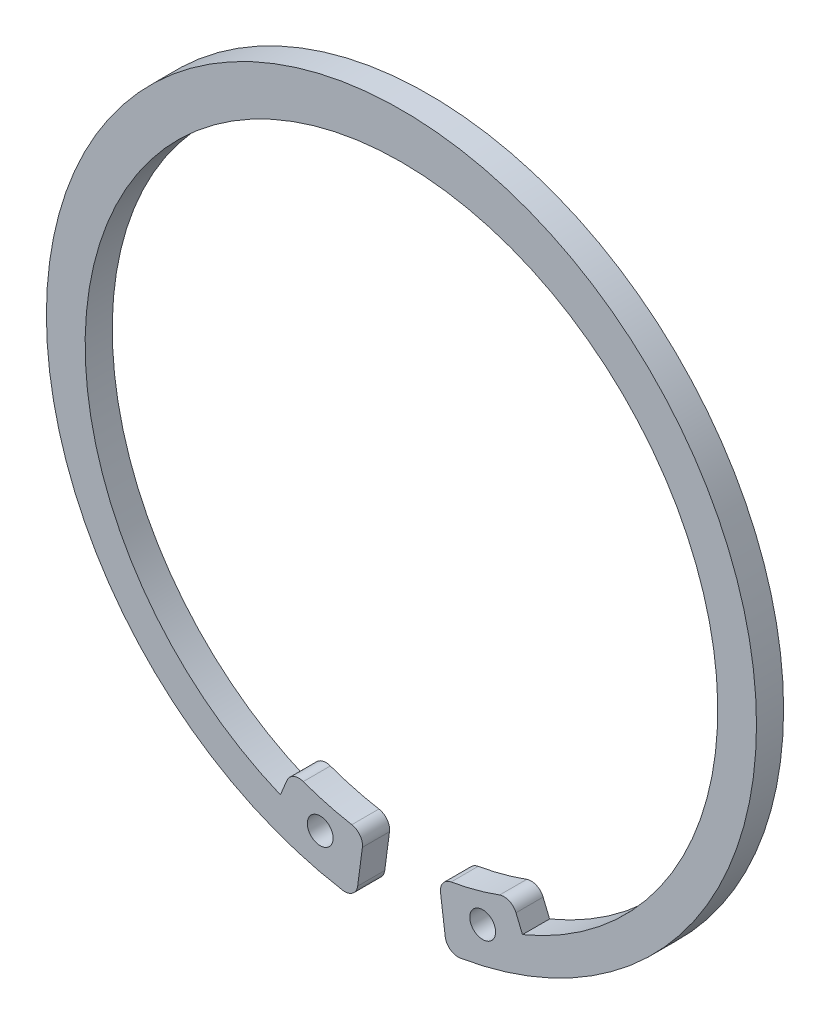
from build123d import *

# Parameters (mm, degrees)
ESQUISSE1_R          = 1
BASE_EXTRUSION_DEPTH = 2.1


with BuildPart() as part:
    # Esquisse1 → Base-Extrusion (new body)
    with BuildSketch(Plane.XY):
        with BuildLine():
            Line((3.392086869, -25.765457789), (3.025942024, -22.984311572))
            ThreePointArc((3.025942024, -22.984311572), (3.211097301, -22.262264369), (3.844255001, -21.86888673))
            ThreePointArc((3.844255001, -21.86888673), (5.746869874, -21.447610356), (7.605220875, -20.861138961))
            ThreePointArc((7.605220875, -20.861138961), (8.350240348, -20.88523514), (8.871613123, -21.417968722))
            Line((8.871613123, -21.417968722), (9.375744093, -22.635048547))
            ThreePointArc((9.375744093, -22.635048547), (0, 24.5), (-9.375744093, -22.635048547))
            Line((-9.375744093, -22.635048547), (-8.871613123, -21.417968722))
            ThreePointArc((-8.871613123, -21.417968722), (-8.350240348, -20.88523514), (-7.605220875, -20.861138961))
            ThreePointArc((-7.605220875, -20.861138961), (-5.746869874, -21.447610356), (-3.844255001, -21.86888673))
            ThreePointArc((-3.844255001, -21.86888673), (-3.211097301, -22.262264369), (-3.025942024, -22.984311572))
            Line((-3.025942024, -22.984311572), (-3.392086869, -25.765457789))
            ThreePointArc((-3.392086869, -25.765457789), (-3.788859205, -26.438899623), (-4.548948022, -26.621155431))
            ThreePointArc((-4.548948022, -26.621155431), (0, 28), (4.548948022, -26.621155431))
            ThreePointArc((4.548948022, -26.621155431), (3.788859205, -26.438899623), (3.392086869, -25.765457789))
        make_face()
        with Locations((-6.29237927, -23.504966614)):
            Circle(ESQUISSE1_R, mode=Mode.SUBTRACT)
        with Locations(Location((6.29237927, -23.504966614, 0), (0, 0, 180))):
            Circle(ESQUISSE1_R, mode=Mode.SUBTRACT)
    extrude(amount=BASE_EXTRUSION_DEPTH)


solid = part.part
